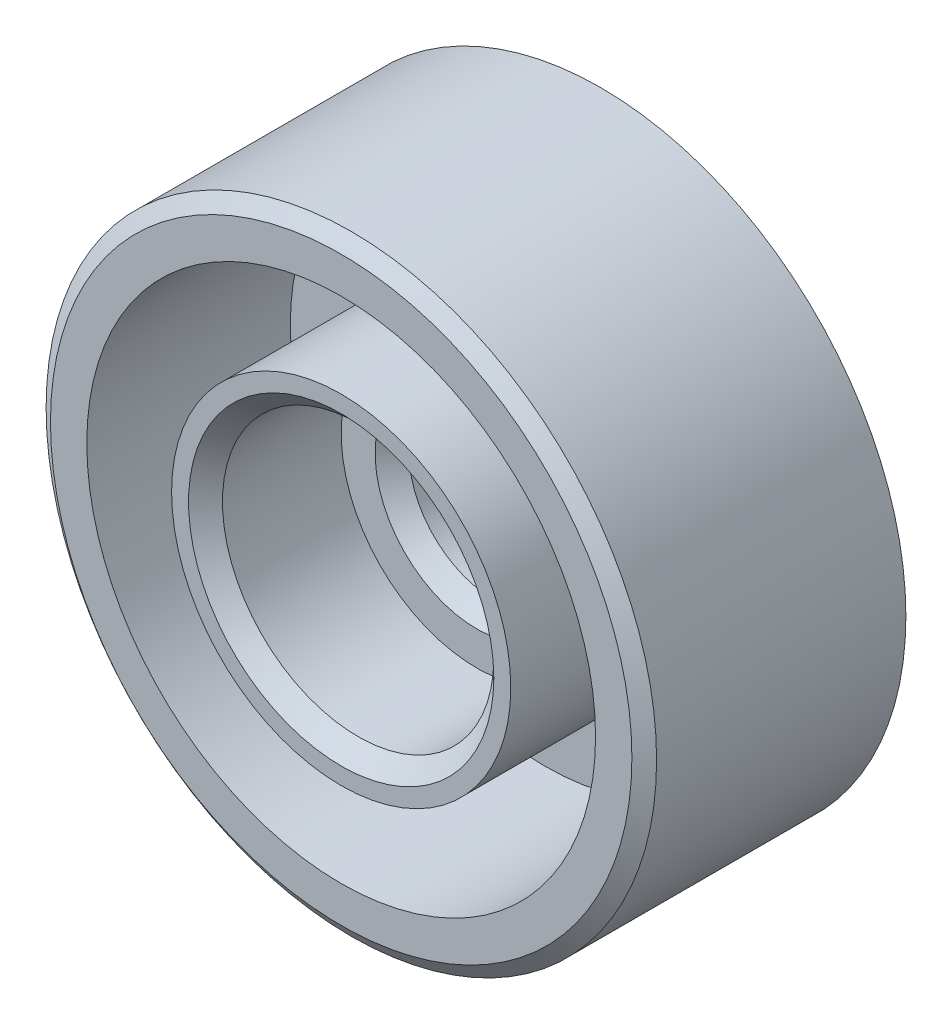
from build123d import *

# Parameters (mm, degrees)
SKETCH_1_R                   = 9
EXTRUDE_1_DEPTH              = 8
SKETCH_2_R                   = 4
CUT_EXTRUDE_1_DEPTH          = 4
SKETCH_3_R                   = 7.5
SKETCH_3_R_2                 = 5
CUT_EXTRUDE_2_DEPTH          = 6
HOLE_WIZARD_M6_8_D           = 5
HOLE_WIZARD_M6_8_CSINK_D     = 6.05
HOLE_WIZARD_M6_8_CSINK_ANGLE = 90
CHAMFER_2_SIZE               = 0.5
CHAMFER_3_SIZE               = 0.5
CHAMFER_3_SIZE2              = 0.350103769
CHAMFER_4_SIZE               = 0.3
CHAMFER_4_SIZE2              = 0.428444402


with BuildPart() as part:
    # Sketch 1 → Extrude 1 (new body)
    with BuildSketch(Plane.XY):
        Circle(SKETCH_1_R)
    extrude(amount=EXTRUDE_1_DEPTH)

    # Sketch 2 → Cut-Extrude 1 (cut)
    with BuildSketch(Plane.XY.offset(8)):
        Circle(SKETCH_2_R)
    extrude(amount=-CUT_EXTRUDE_1_DEPTH, mode=Mode.SUBTRACT)

    # Sketch 3 → Cut-Extrude 2 (cut)
    with BuildSketch(Plane.XY.offset(8)):
        Circle(SKETCH_3_R)
        Circle(SKETCH_3_R_2, mode=Mode.SUBTRACT)
    extrude(amount=-CUT_EXTRUDE_2_DEPTH, mode=Mode.SUBTRACT)

    # Hole Wizard M6 _8 (through all)
    with Locations(Plane(origin=(0, 0, 0), x_dir=(-1, 0, 0), z_dir=(0, 0, -1))):
        with Locations((0, 0)):
            CounterSinkHole(HOLE_WIZARD_M6_8_D / 2, HOLE_WIZARD_M6_8_CSINK_D / 2, counter_sink_angle=HOLE_WIZARD_M6_8_CSINK_ANGLE)

    # Chamfer 2
    chamfer_2_edges = [part.edges().sort_by_distance(p)[0] for p in [
        (-2.5, 0, 4),
        (-4, 0, 8),
    ]]
    chamfer(chamfer_2_edges, length=CHAMFER_2_SIZE)

    # Chamfer 3
    chamfer_3_edges = [part.edges().sort_by_distance(p)[0] for p in [
        (-9, 0, 0),
    ]]
    chamfer_3_side = [part.faces().sort_by_distance(p)[0] for p in [
        (-8.745441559, 0, 0),
    ]]
    chamfer(chamfer_3_edges, length=CHAMFER_3_SIZE, length2=CHAMFER_3_SIZE2, reference=chamfer_3_side[0])

    # Chamfer 4
    chamfer_4_edges = [part.edges().sort_by_distance(p)[0] for p in [
        (-9, 0, 8),
    ]]
    chamfer_4_side = [part.faces().sort_by_distance(p)[0] for p in [
        (-9, 0, 4.175051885),
    ]]
    chamfer(chamfer_4_edges, length=CHAMFER_4_SIZE, length2=CHAMFER_4_SIZE2, reference=chamfer_4_side[0])


solid = part.part
